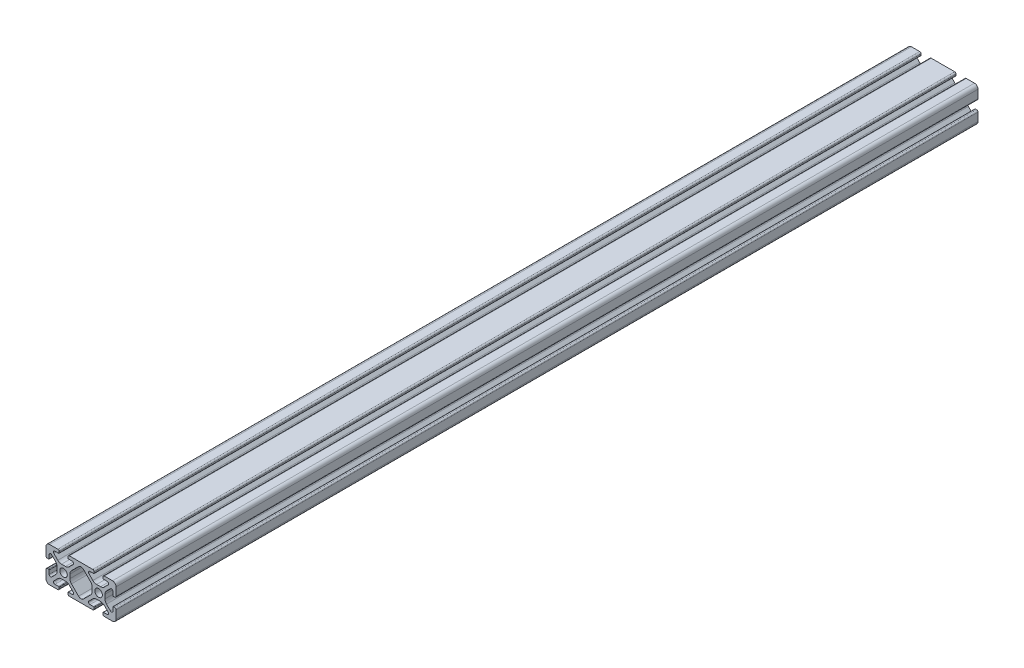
from build123d import *

# Parameters (mm, degrees)
SKIZZE1_R               = 2.15
LINEAR_AUSTRAGEN1_DEPTH = 492


with BuildPart() as part:
    # Skizze1 → Linear austragen1 (new body)
    with BuildSketch(Plane.XY):
        with BuildLine():
            Line((32.5, 1.5), (32.5, 0.8))
            ThreePointArc((32.5, 0.8), (32.734314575, 0.234314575), (33.3, 0))
            Line((33.3, 0), (38, 0))
            ThreePointArc((38, 0), (39.414213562, 0.585786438), (40, 2))
            Line((40, 2), (40, 6.7))
            ThreePointArc((40, 6.7), (39.765685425, 7.265685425), (39.2, 7.5))
            Line((39.2, 7.5), (38.5, 7.5))
            ThreePointArc((38.5, 7.5), (38.287867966, 7.412132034), (38.2, 7.2))
            Line((38.2, 7.2), (38.2, 5.081575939))
            ThreePointArc((38.2, 5.081575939), (37.686654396, 4.313299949), (36.780411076, 4.493562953))
            Line((36.780411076, 4.493562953), (34.528679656, 6.745294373))
            ThreePointArc((34.528679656, 6.745294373), (33.878361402, 7.718564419), (33.65, 8.866614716))
            Line((33.65, 8.866614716), (33.65, 11.133385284))
            ThreePointArc((33.65, 11.133385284), (33.878361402, 12.281435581), (34.528679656, 13.254705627))
            Line((34.528679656, 13.254705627), (36.780411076, 15.506437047))
            ThreePointArc((36.780411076, 15.506437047), (37.686654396, 15.686700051), (38.2, 14.918424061))
            Line((38.2, 14.918424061), (38.2, 12.8))
            ThreePointArc((38.2, 12.8), (38.287867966, 12.587867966), (38.5, 12.5))
            Line((38.5, 12.5), (39.2, 12.5))
            ThreePointArc((39.2, 12.5), (39.765685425, 12.734314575), (40, 13.3))
            Line((40, 13.3), (40, 18))
            ThreePointArc((40, 18), (39.414213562, 19.414213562), (38, 20))
            Line((38, 20), (33.3, 20))
            ThreePointArc((33.3, 20), (32.734314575, 19.765685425), (32.5, 19.2))
            Line((32.5, 19.2), (32.5, 18.5))
            ThreePointArc((32.5, 18.5), (32.587867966, 18.287867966), (32.8, 18.2))
            Line((32.8, 18.2), (34.91960939, 18.2))
            ThreePointArc((34.91960939, 18.2), (35.687886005, 17.686653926), (35.507622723, 16.780409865))
            Line((35.507622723, 16.780409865), (33.25589129, 14.528679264))
            ThreePointArc((33.25589129, 14.528679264), (32.282621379, 13.878361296), (31.134571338, 13.65))
            Line((31.134571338, 13.65), (28.866614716, 13.65))
            ThreePointArc((28.866614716, 13.65), (27.718564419, 13.878361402), (26.745294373, 14.528679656))
            Line((26.745294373, 14.528679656), (24.493562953, 16.780411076))
            ThreePointArc((24.493562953, 16.780411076), (24.313299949, 17.686654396), (25.081575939, 18.2))
            Line((25.081575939, 18.2), (27.2, 18.2))
            ThreePointArc((27.2, 18.2), (27.412132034, 18.287867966), (27.5, 18.5))
            Line((27.5, 18.5), (27.5, 19.2))
            ThreePointArc((27.5, 19.2), (27.265685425, 19.765685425), (26.7, 20))
            Line((26.7, 20), (13.3, 20))
            ThreePointArc((13.3, 20), (12.734314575, 19.765685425), (12.5, 19.2))
            Line((12.5, 19.2), (12.5, 18.5))
            ThreePointArc((12.5, 18.5), (12.587867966, 18.287867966), (12.8, 18.2))
            Line((12.8, 18.2), (14.918424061, 18.2))
            ThreePointArc((14.918424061, 18.2), (15.686700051, 17.686654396), (15.506437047, 16.780411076))
            Line((15.506437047, 16.780411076), (13.254705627, 14.528679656))
            ThreePointArc((13.254705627, 14.528679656), (12.281435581, 13.878361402), (11.133385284, 13.65))
            Line((11.133385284, 13.65), (8.866614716, 13.65))
            ThreePointArc((8.866614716, 13.65), (7.718564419, 13.878361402), (6.745294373, 14.528679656))
            Line((6.745294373, 14.528679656), (4.493562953, 16.780411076))
            ThreePointArc((4.493562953, 16.780411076), (4.313299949, 17.686654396), (5.081575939, 18.2))
            Line((5.081575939, 18.2), (7.2, 18.2))
            ThreePointArc((7.2, 18.2), (7.412132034, 18.287867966), (7.5, 18.5))
            Line((7.5, 18.5), (7.5, 19.2))
            ThreePointArc((7.5, 19.2), (7.265685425, 19.765685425), (6.7, 20))
            Line((6.7, 20), (2, 20))
            ThreePointArc((2, 20), (0.585786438, 19.414213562), (0, 18))
            Line((0, 18), (0, 13.3))
            ThreePointArc((0, 13.3), (0.234314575, 12.734314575), (0.8, 12.5))
            Line((0.8, 12.5), (1.5, 12.5))
            ThreePointArc((1.5, 12.5), (1.712132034, 12.587867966), (1.8, 12.8))
            Line((1.8, 12.8), (1.8, 14.918424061))
            ThreePointArc((1.8, 14.918424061), (2.313345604, 15.686700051), (3.219588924, 15.506437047))
            Line((3.219588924, 15.506437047), (5.471320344, 13.254705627))
            ThreePointArc((5.471320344, 13.254705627), (6.121638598, 12.281435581), (6.35, 11.133385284))
            Line((6.35, 11.133385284), (6.35, 8.866614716))
            ThreePointArc((6.35, 8.866614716), (6.121638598, 7.718564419), (5.471320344, 6.745294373))
            Line((5.471320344, 6.745294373), (3.219588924, 4.493562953))
            ThreePointArc((3.219588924, 4.493562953), (2.313345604, 4.313299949), (1.8, 5.081575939))
            Line((1.8, 5.081575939), (1.8, 7.2))
            ThreePointArc((1.8, 7.2), (1.712132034, 7.412132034), (1.5, 7.5))
            Line((1.5, 7.5), (0.8, 7.5))
            ThreePointArc((0.8, 7.5), (0.234314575, 7.265685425), (0, 6.7))
            Line((0, 6.7), (0, 2))
            ThreePointArc((0, 2), (0.585786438, 0.585786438), (2, 0))
            Line((2, 0), (6.7, 0))
            ThreePointArc((6.7, 0), (7.265685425, 0.234314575), (7.5, 0.8))
            Line((7.5, 0.8), (7.5, 1.5))
            ThreePointArc((7.5, 1.5), (7.412132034, 1.712132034), (7.2, 1.8))
            Line((7.2, 1.8), (5.081575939, 1.8))
            ThreePointArc((5.081575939, 1.8), (4.313299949, 2.313345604), (4.493562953, 3.219588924))
            Line((4.493562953, 3.219588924), (6.745294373, 5.471320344))
            ThreePointArc((6.745294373, 5.471320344), (7.718564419, 6.121638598), (8.866614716, 6.35))
            Line((8.866614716, 6.35), (11.133385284, 6.35))
            ThreePointArc((11.133385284, 6.35), (12.281435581, 6.121638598), (13.254705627, 5.471320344))
            Line((13.254705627, 5.471320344), (15.506437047, 3.219588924))
            ThreePointArc((15.506437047, 3.219588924), (15.686700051, 2.313345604), (14.918424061, 1.8))
            Line((14.918424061, 1.8), (12.8, 1.8))
            ThreePointArc((12.8, 1.8), (12.587867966, 1.712132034), (12.5, 1.5))
            Line((12.5, 1.5), (12.5, 0.8))
            ThreePointArc((12.5, 0.8), (12.734314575, 0.234314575), (13.3, 0))
            Line((13.3, 0), (26.7, 0))
            ThreePointArc((26.7, 0), (27.265685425, 0.234314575), (27.5, 0.8))
            Line((27.5, 0.8), (27.5, 1.5))
            ThreePointArc((27.5, 1.5), (27.412132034, 1.712132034), (27.2, 1.8))
            Line((27.2, 1.8), (25.081575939, 1.8))
            ThreePointArc((25.081575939, 1.8), (24.313299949, 2.313345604), (24.493562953, 3.219588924))
            Line((24.493562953, 3.219588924), (26.745294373, 5.471320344))
            ThreePointArc((26.745294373, 5.471320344), (27.718564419, 6.121638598), (28.866614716, 6.35))
            Line((28.866614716, 6.35), (31.134572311, 6.35))
            ThreePointArc((31.134572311, 6.35), (32.282622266, 6.121638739), (33.255892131, 5.471320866))
            Line((33.255892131, 5.471320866), (35.507623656, 3.219590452))
            ThreePointArc((35.507623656, 3.219590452), (35.68788702, 2.313346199), (34.919610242, 1.8))
            Line((34.919610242, 1.8), (32.8, 1.8))
            ThreePointArc((32.8, 1.8), (32.587867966, 1.712132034), (32.5, 1.5))
        make_face()
        with Locations(Location((10, 10, 0), (0, 0, 180))):
            Circle(SKIZZE1_R, mode=Mode.SUBTRACT)
        with Locations(Location((30, 10, 0), (0, 0, 180))):
            Circle(SKIZZE1_R, mode=Mode.SUBTRACT)
        with BuildLine():
            Line((18.586377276, 2.687596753), (14.529271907, 6.744702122))
            ThreePointArc((14.529271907, 6.744702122), (13.878953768, 7.717971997), (13.650592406, 8.866022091))
            Line((13.650592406, 8.866022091), (13.650592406, 11.133977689))
            ThreePointArc((13.650592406, 11.133977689), (13.878953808, 12.282027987), (14.529272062, 13.255298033))
            Line((14.529272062, 13.255298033), (18.586377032, 17.312403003))
            ThreePointArc((18.586377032, 17.312403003), (20.000590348, 17.898189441), (21.414803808, 17.312403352))
            Line((21.414803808, 17.312403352), (25.471911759, 13.255297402))
            ThreePointArc((25.471911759, 13.255297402), (26.122230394, 12.282027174), (26.350591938, 11.133976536))
            Line((26.350591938, 11.133976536), (26.350591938, 8.866023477))
            ThreePointArc((26.350591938, 8.866023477), (26.122230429, 7.717972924), (25.471911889, 6.744702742))
            Line((25.471911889, 6.744702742), (21.414804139, 2.687596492))
            ThreePointArc((21.414804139, 2.687596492), (20.000590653, 2.101810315), (18.586377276, 2.687596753))
        make_face(mode=Mode.SUBTRACT)
    extrude(amount=-LINEAR_AUSTRAGEN1_DEPTH)


solid = part.part
